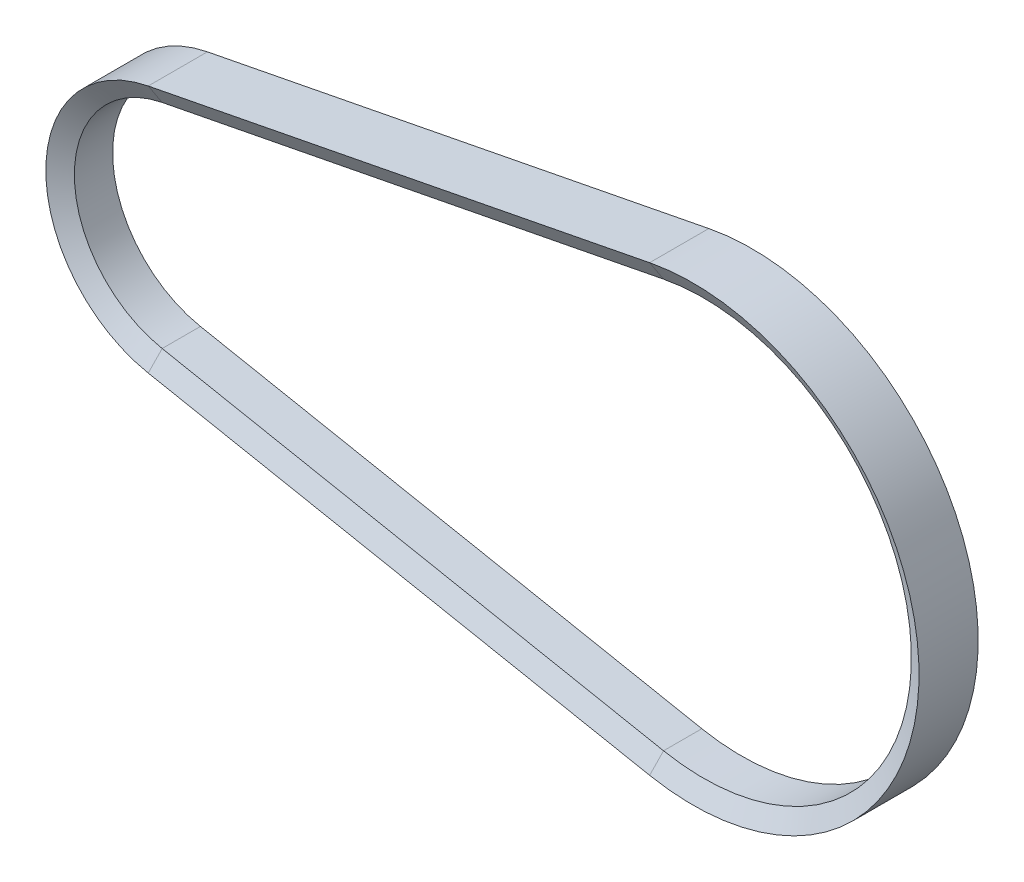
from build123d import *


with BuildPart() as part:
    # Balayage1: sweep along a path in Esquisse1
    with BuildLine(Plane.XY) as balayage1_path:
        Line((26.566147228, 11.287827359), (-1.147227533, 5.889301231))
        ThreePointArc((-1.147227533, 5.889301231), (-6, 0), (-1.147227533, -5.889301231))
        Line((-1.147227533, -5.889301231), (26.566147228, -11.287827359))
        ThreePointArc((26.566147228, -11.287827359), (40.265, 0), (26.566147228, 11.287827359))
    # Esquisse2 → Balayage1 (sweep)
    with BuildSketch(Plane(origin=(0, 0, 0), x_dir=(1, 0, 0), z_dir=(0, 1, 0))):
        Polygon((-7, -1.635), (-7, 1.635), (-6, 1.057649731), (-6, -1.057649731), align=None)
    sweep(path=balayage1_path.line)


solid = part.part
